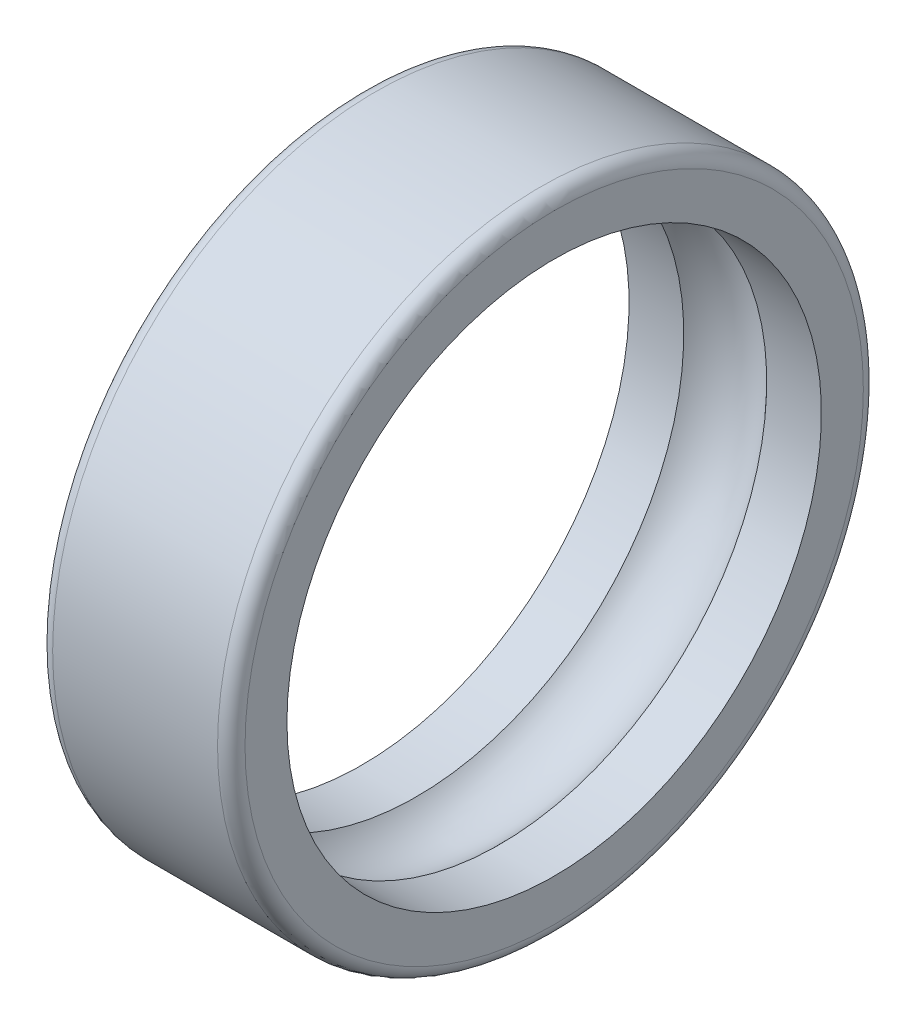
ISO-10303-21;
HEADER;
FILE_DESCRIPTION(('STEP AP214'),'2;1');
FILE_NAME('part.step','',(''),(''),'','','');
FILE_SCHEMA(('AUTOMOTIVE_DESIGN { 1 0 10303 214 1 1 1 1 }'));
ENDSEC;
DATA;
#1=APPLICATION_CONTEXT('core data for automotive mechanical design processes');
#2=APPLICATION_PROTOCOL_DEFINITION('international standard','automotive_design',2000,#1);
#3=PRODUCT_CONTEXT('',#1,'mechanical');
#4=PRODUCT('Part','Part','',(#3));
#5=PRODUCT_RELATED_PRODUCT_CATEGORY('part','',(#4));
#6=PRODUCT_DEFINITION_FORMATION('','',#4);
#7=PRODUCT_DEFINITION_CONTEXT('part definition',#1,'design');
#8=PRODUCT_DEFINITION('design','',#6,#7);
#9=PRODUCT_DEFINITION_SHAPE('','',#8);
#10=(LENGTH_UNIT() NAMED_UNIT(*) SI_UNIT(.MILLI.,.METRE.));
#11=(NAMED_UNIT(*) PLANE_ANGLE_UNIT() SI_UNIT($,.RADIAN.));
#12=(NAMED_UNIT(*) SI_UNIT($,.STERADIAN.) SOLID_ANGLE_UNIT());
#13=UNCERTAINTY_MEASURE_WITH_UNIT(LENGTH_MEASURE(1.E-05),#10,'distance_accuracy_value','');
#14=(GEOMETRIC_REPRESENTATION_CONTEXT(3) GLOBAL_UNCERTAINTY_ASSIGNED_CONTEXT((#13)) GLOBAL_UNIT_ASSIGNED_CONTEXT((#10,
#11,#12)) REPRESENTATION_CONTEXT('',''));
#15=CARTESIAN_POINT('',(0.,0.,0.));
#16=DIRECTION('',(0.,0.,1.));
#17=DIRECTION('',(1.,0.,0.));
#18=AXIS2_PLACEMENT_3D('',#15,#16,#17);
#19=CARTESIAN_POINT('',(1.,0.,0.));
#20=DIRECTION('',(-1.,0.,0.));
#21=DIRECTION('',(0.,0.,1.));
#22=AXIS2_PLACEMENT_3D('',#19,#20,#21);
#23=TOROIDAL_SURFACE('',#22,22.5,1.);
#24=CARTESIAN_POINT('',(0.,0.,0.));
#25=DIRECTION('',(-1.,0.,0.));
#26=DIRECTION('',(0.,0.,1.));
#27=AXIS2_PLACEMENT_3D('',#24,#25,#26);
#28=CIRCLE('',#27,22.5);
#29=CARTESIAN_POINT('',(0.,0.,22.5));
#30=VERTEX_POINT('',#29);
#31=EDGE_CURVE('E10',#30,#30,#28,.T.);
#32=ORIENTED_EDGE('',*,*,#31,.F.);
#33=EDGE_LOOP('',(#32));
#34=FACE_BOUND('',#33,.T.);
#35=CARTESIAN_POINT('',(1.,0.,0.));
#36=DIRECTION('',(-1.,0.,0.));
#37=DIRECTION('',(0.,0.,1.));
#38=AXIS2_PLACEMENT_3D('',#35,#36,#37);
#39=CIRCLE('',#38,23.5);
#40=CARTESIAN_POINT('',(1.00000000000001,0.,23.5));
#41=VERTEX_POINT('',#40);
#42=EDGE_CURVE('E53',#41,#41,#39,.T.);
#43=ORIENTED_EDGE('',*,*,#42,.T.);
#44=EDGE_LOOP('',(#43));
#45=FACE_BOUND('',#44,.T.);
#46=ADVANCED_FACE('F25',(#34,#45),#23,.T.);
#47=CARTESIAN_POINT('',(0.,0.,-22.5));
#48=DIRECTION('',(1.,0.,0.));
#49=DIRECTION('',(0.,0.,-1.));
#50=AXIS2_PLACEMENT_3D('',#47,#48,#49);
#51=PLANE('',#50);
#52=CARTESIAN_POINT('',(0.,0.,0.));
#53=DIRECTION('',(-1.,0.,0.));
#54=DIRECTION('',(0.,0.,1.));
#55=AXIS2_PLACEMENT_3D('',#52,#53,#54);
#56=CIRCLE('',#55,19.45);
#57=CARTESIAN_POINT('',(0.,0.,19.45));
#58=VERTEX_POINT('',#57);
#59=EDGE_CURVE('E31',#58,#58,#56,.T.);
#60=ORIENTED_EDGE('',*,*,#59,.F.);
#61=EDGE_LOOP('',(#60));
#62=FACE_BOUND('',#61,.T.);
#63=ORIENTED_EDGE('',*,*,#31,.T.);
#64=EDGE_LOOP('',(#63));
#65=FACE_BOUND('',#64,.T.);
#66=ADVANCED_FACE('F90',(#62,#65),#51,.F.);
#67=CARTESIAN_POINT('',(0.,0.,0.));
#68=DIRECTION('',(-1.,0.,0.));
#69=DIRECTION('',(0.,0.,1.));
#70=AXIS2_PLACEMENT_3D('',#67,#68,#69);
#71=CYLINDRICAL_SURFACE('',#70,19.45);
#72=CARTESIAN_POINT('',(3.98130823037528,0.,0.));
#73=DIRECTION('',(-1.,0.,0.));
#74=DIRECTION('',(0.,0.,1.));
#75=AXIS2_PLACEMENT_3D('',#72,#73,#74);
#76=CIRCLE('',#75,19.45);
#77=CARTESIAN_POINT('',(3.98130823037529,0.,19.45));
#78=VERTEX_POINT('',#77);
#79=EDGE_CURVE('E35',#78,#78,#76,.T.);
#80=ORIENTED_EDGE('',*,*,#79,.F.);
#81=EDGE_LOOP('',(#80));
#82=FACE_BOUND('',#81,.T.);
#83=ORIENTED_EDGE('',*,*,#59,.T.);
#84=EDGE_LOOP('',(#83));
#85=FACE_BOUND('',#84,.T.);
#86=ADVANCED_FACE('F85',(#82,#85),#71,.F.);
#87=CARTESIAN_POINT('',(7.,0.,0.));
#88=DIRECTION('',(-1.,0.,0.));
#89=DIRECTION('',(0.,0.,1.));
#90=AXIS2_PLACEMENT_3D('',#87,#88,#89);
#91=TOROIDAL_SURFACE('',#90,16.75,4.05);
#92=CARTESIAN_POINT('',(10.0186917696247,0.,0.));
#93=DIRECTION('',(-1.,0.,0.));
#94=DIRECTION('',(0.,0.,1.));
#95=AXIS2_PLACEMENT_3D('',#92,#93,#94);
#96=CIRCLE('',#95,19.45);
#97=CARTESIAN_POINT('',(10.0186917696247,0.,19.45));
#98=VERTEX_POINT('',#97);
#99=EDGE_CURVE('E39',#98,#98,#96,.T.);
#100=ORIENTED_EDGE('',*,*,#99,.F.);
#101=EDGE_LOOP('',(#100));
#102=FACE_BOUND('',#101,.T.);
#103=ORIENTED_EDGE('',*,*,#79,.T.);
#104=EDGE_LOOP('',(#103));
#105=FACE_BOUND('',#104,.T.);
#106=ADVANCED_FACE('F79',(#102,#105),#91,.F.);
#107=CARTESIAN_POINT('',(0.,0.,0.));
#108=DIRECTION('',(-1.,0.,0.));
#109=DIRECTION('',(0.,0.,1.));
#110=AXIS2_PLACEMENT_3D('',#107,#108,#109);
#111=CYLINDRICAL_SURFACE('',#110,19.45);
#112=CARTESIAN_POINT('',(14.,0.,0.));
#113=DIRECTION('',(-1.,0.,0.));
#114=DIRECTION('',(0.,0.,1.));
#115=AXIS2_PLACEMENT_3D('',#112,#113,#114);
#116=CIRCLE('',#115,19.45);
#117=CARTESIAN_POINT('',(14.,0.,19.45));
#118=VERTEX_POINT('',#117);
#119=EDGE_CURVE('E44',#118,#118,#116,.T.);
#120=ORIENTED_EDGE('',*,*,#119,.F.);
#121=EDGE_LOOP('',(#120));
#122=FACE_BOUND('',#121,.T.);
#123=ORIENTED_EDGE('',*,*,#99,.T.);
#124=EDGE_LOOP('',(#123));
#125=FACE_BOUND('',#124,.T.);
#126=ADVANCED_FACE('F73',(#122,#125),#111,.F.);
#127=CARTESIAN_POINT('',(14.,0.,-22.5));
#128=DIRECTION('',(-1.,0.,0.));
#129=DIRECTION('',(0.,0.,1.));
#130=AXIS2_PLACEMENT_3D('',#127,#128,#129);
#131=PLANE('',#130);
#132=CARTESIAN_POINT('',(14.,0.,0.));
#133=DIRECTION('',(-1.,0.,0.));
#134=DIRECTION('',(0.,0.,1.));
#135=AXIS2_PLACEMENT_3D('',#132,#133,#134);
#136=CIRCLE('',#135,22.5);
#137=CARTESIAN_POINT('',(14.,0.,22.5));
#138=VERTEX_POINT('',#137);
#139=EDGE_CURVE('E47',#138,#138,#136,.T.);
#140=ORIENTED_EDGE('',*,*,#139,.F.);
#141=EDGE_LOOP('',(#140));
#142=FACE_BOUND('',#141,.T.);
#143=ORIENTED_EDGE('',*,*,#119,.T.);
#144=EDGE_LOOP('',(#143));
#145=FACE_BOUND('',#144,.T.);
#146=ADVANCED_FACE('F67',(#142,#145),#131,.F.);
#147=CARTESIAN_POINT('',(13.,0.,0.));
#148=DIRECTION('',(-1.,0.,0.));
#149=DIRECTION('',(0.,0.,1.));
#150=AXIS2_PLACEMENT_3D('',#147,#148,#149);
#151=TOROIDAL_SURFACE('',#150,22.5,1.);
#152=CARTESIAN_POINT('',(13.,0.,0.));
#153=DIRECTION('',(-1.,0.,0.));
#154=DIRECTION('',(0.,0.,1.));
#155=AXIS2_PLACEMENT_3D('',#152,#153,#154);
#156=CIRCLE('',#155,23.5);
#157=CARTESIAN_POINT('',(13.,0.,23.5));
#158=VERTEX_POINT('',#157);
#159=EDGE_CURVE('E50',#158,#158,#156,.T.);
#160=ORIENTED_EDGE('',*,*,#159,.F.);
#161=EDGE_LOOP('',(#160));
#162=FACE_BOUND('',#161,.T.);
#163=ORIENTED_EDGE('',*,*,#139,.T.);
#164=EDGE_LOOP('',(#163));
#165=FACE_BOUND('',#164,.T.);
#166=ADVANCED_FACE('F61',(#162,#165),#151,.T.);
#167=CARTESIAN_POINT('',(0.,0.,0.));
#168=DIRECTION('',(-1.,0.,0.));
#169=DIRECTION('',(0.,0.,1.));
#170=AXIS2_PLACEMENT_3D('',#167,#168,#169);
#171=CYLINDRICAL_SURFACE('',#170,23.5);
#172=ORIENTED_EDGE('',*,*,#42,.F.);
#173=EDGE_LOOP('',(#172));
#174=FACE_BOUND('',#173,.T.);
#175=ORIENTED_EDGE('',*,*,#159,.T.);
#176=EDGE_LOOP('',(#175));
#177=FACE_BOUND('',#176,.T.);
#178=ADVANCED_FACE('F58',(#174,#177),#171,.T.);
#179=CLOSED_SHELL('',(#46,#66,#86,#106,#126,#146,#166,#178));
#180=MANIFOLD_SOLID_BREP('B2',#179);
#181=ADVANCED_BREP_SHAPE_REPRESENTATION('',(#18,#180),#14);
#182=SHAPE_DEFINITION_REPRESENTATION(#9,#181);
ENDSEC;
END-ISO-10303-21;
